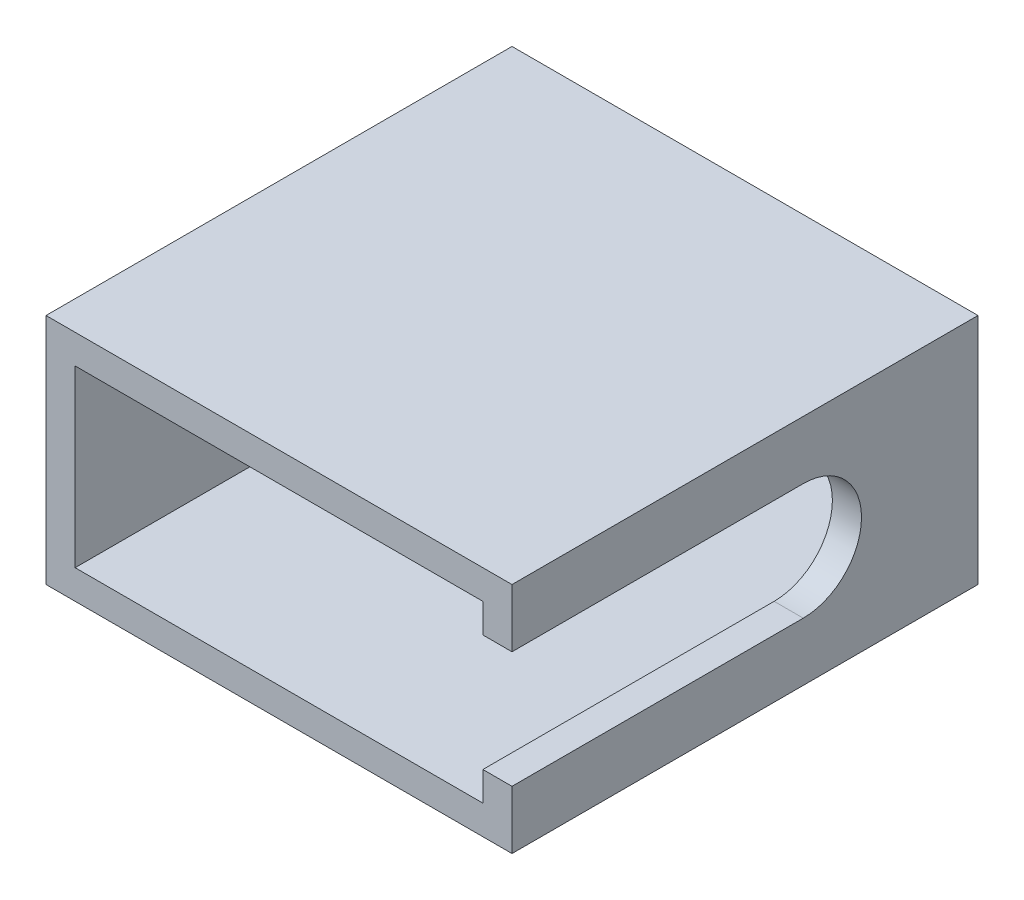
ISO-10303-21;
HEADER;
FILE_DESCRIPTION(('STEP AP214'),'2;1');
FILE_NAME('part.step','',(''),(''),'','','');
FILE_SCHEMA(('AUTOMOTIVE_DESIGN { 1 0 10303 214 1 1 1 1 }'));
ENDSEC;
DATA;
#1=APPLICATION_CONTEXT('core data for automotive mechanical design processes');
#2=APPLICATION_PROTOCOL_DEFINITION('international standard','automotive_design',2000,#1);
#3=PRODUCT_CONTEXT('',#1,'mechanical');
#4=PRODUCT('Part','Part','',(#3));
#5=PRODUCT_RELATED_PRODUCT_CATEGORY('part','',(#4));
#6=PRODUCT_DEFINITION_FORMATION('','',#4);
#7=PRODUCT_DEFINITION_CONTEXT('part definition',#1,'design');
#8=PRODUCT_DEFINITION('design','',#6,#7);
#9=PRODUCT_DEFINITION_SHAPE('','',#8);
#10=(LENGTH_UNIT() NAMED_UNIT(*) SI_UNIT(.MILLI.,.METRE.));
#11=(NAMED_UNIT(*) PLANE_ANGLE_UNIT() SI_UNIT($,.RADIAN.));
#12=(NAMED_UNIT(*) SI_UNIT($,.STERADIAN.) SOLID_ANGLE_UNIT());
#13=UNCERTAINTY_MEASURE_WITH_UNIT(LENGTH_MEASURE(1.E-05),#10,'distance_accuracy_value','');
#14=(GEOMETRIC_REPRESENTATION_CONTEXT(3) GLOBAL_UNCERTAINTY_ASSIGNED_CONTEXT((#13)) GLOBAL_UNIT_ASSIGNED_CONTEXT((#10,
#11,#12)) REPRESENTATION_CONTEXT('',''));
#15=CARTESIAN_POINT('',(0.,0.,0.));
#16=DIRECTION('',(0.,0.,1.));
#17=DIRECTION('',(1.,0.,0.));
#18=AXIS2_PLACEMENT_3D('',#15,#16,#17);
#19=CARTESIAN_POINT('',(-25.4,-12.7,0.));
#20=DIRECTION('',(0.,-1.,0.));
#21=DIRECTION('',(0.,0.,-1.));
#22=AXIS2_PLACEMENT_3D('',#19,#20,#21);
#23=PLANE('',#22);
#24=DIRECTION('',(1.,0.,0.));
#25=VECTOR('',#24,1.);
#26=CARTESIAN_POINT('',(-25.4,-12.7,50.8));
#27=LINE('',#26,#25);
#28=CARTESIAN_POINT('',(-25.4,-12.7,50.8));
#29=VERTEX_POINT('',#28);
#30=CARTESIAN_POINT('',(25.4,-12.7,50.8));
#31=VERTEX_POINT('',#30);
#32=EDGE_CURVE('E147',#29,#31,#27,.T.);
#33=ORIENTED_EDGE('',*,*,#32,.F.);
#34=DIRECTION('',(0.,0.,1.));
#35=VECTOR('',#34,1.);
#36=CARTESIAN_POINT('',(-25.4,-12.7,0.));
#37=LINE('',#36,#35);
#38=CARTESIAN_POINT('',(-25.4,-12.7,0.));
#39=VERTEX_POINT('',#38);
#40=EDGE_CURVE('E11',#39,#29,#37,.T.);
#41=ORIENTED_EDGE('',*,*,#40,.F.);
#42=DIRECTION('',(1.,0.,0.));
#43=VECTOR('',#42,1.);
#44=CARTESIAN_POINT('',(-25.4,-12.7,0.));
#45=LINE('',#44,#43);
#46=CARTESIAN_POINT('',(25.4,-12.7,0.));
#47=VERTEX_POINT('',#46);
#48=EDGE_CURVE('E157',#39,#47,#45,.T.);
#49=ORIENTED_EDGE('',*,*,#48,.T.);
#50=DIRECTION('',(0.,0.,1.));
#51=VECTOR('',#50,1.);
#52=CARTESIAN_POINT('',(25.4,-12.7,0.));
#53=LINE('',#52,#51);
#54=EDGE_CURVE('E34',#47,#31,#53,.T.);
#55=ORIENTED_EDGE('',*,*,#54,.T.);
#56=EDGE_LOOP('',(#33,#41,#49,#55));
#57=FACE_BOUND('',#56,.T.);
#58=ADVANCED_FACE('F31',(#57),#23,.T.);
#59=CARTESIAN_POINT('',(-25.4,12.7,0.));
#60=DIRECTION('',(-1.,0.,0.));
#61=DIRECTION('',(0.,0.,1.));
#62=AXIS2_PLACEMENT_3D('',#59,#60,#61);
#63=PLANE('',#62);
#64=DIRECTION('',(0.,-1.,0.));
#65=VECTOR('',#64,1.);
#66=CARTESIAN_POINT('',(-25.4,12.7,50.8));
#67=LINE('',#66,#65);
#68=CARTESIAN_POINT('',(-25.4,12.7,50.8));
#69=VERTEX_POINT('',#68);
#70=EDGE_CURVE('E152',#69,#29,#67,.T.);
#71=ORIENTED_EDGE('',*,*,#70,.F.);
#72=DIRECTION('',(0.,0.,1.));
#73=VECTOR('',#72,1.);
#74=CARTESIAN_POINT('',(-25.4,12.7,0.));
#75=LINE('',#74,#73);
#76=CARTESIAN_POINT('',(-25.4,12.7,0.));
#77=VERTEX_POINT('',#76);
#78=EDGE_CURVE('E39',#77,#69,#75,.T.);
#79=ORIENTED_EDGE('',*,*,#78,.F.);
#80=DIRECTION('',(0.,-1.,0.));
#81=VECTOR('',#80,1.);
#82=CARTESIAN_POINT('',(-25.4,12.7,0.));
#83=LINE('',#82,#81);
#84=EDGE_CURVE('E164',#77,#39,#83,.T.);
#85=ORIENTED_EDGE('',*,*,#84,.T.);
#86=ORIENTED_EDGE('',*,*,#40,.T.);
#87=EDGE_LOOP('',(#71,#79,#85,#86));
#88=FACE_BOUND('',#87,.T.);
#89=ADVANCED_FACE('F249',(#88),#63,.T.);
#90=CARTESIAN_POINT('',(25.4,12.7,0.));
#91=DIRECTION('',(0.,1.,0.));
#92=DIRECTION('',(0.,0.,1.));
#93=AXIS2_PLACEMENT_3D('',#90,#91,#92);
#94=PLANE('',#93);
#95=DIRECTION('',(-1.,0.,0.));
#96=VECTOR('',#95,1.);
#97=CARTESIAN_POINT('',(25.4,12.7,50.8));
#98=LINE('',#97,#96);
#99=CARTESIAN_POINT('',(25.4,12.7,50.8));
#100=VERTEX_POINT('',#99);
#101=EDGE_CURVE('E148',#100,#69,#98,.T.);
#102=ORIENTED_EDGE('',*,*,#101,.F.);
#103=DIRECTION('',(0.,0.,1.));
#104=VECTOR('',#103,1.);
#105=CARTESIAN_POINT('',(25.4,12.7,0.));
#106=LINE('',#105,#104);
#107=CARTESIAN_POINT('',(25.4,12.7,0.));
#108=VERTEX_POINT('',#107);
#109=EDGE_CURVE('E159',#108,#100,#106,.T.);
#110=ORIENTED_EDGE('',*,*,#109,.F.);
#111=DIRECTION('',(-1.,0.,0.));
#112=VECTOR('',#111,1.);
#113=CARTESIAN_POINT('',(25.4,12.7,0.));
#114=LINE('',#113,#112);
#115=EDGE_CURVE('E168',#108,#77,#114,.T.);
#116=ORIENTED_EDGE('',*,*,#115,.T.);
#117=ORIENTED_EDGE('',*,*,#78,.T.);
#118=EDGE_LOOP('',(#102,#110,#116,#117));
#119=FACE_BOUND('',#118,.T.);
#120=ADVANCED_FACE('F253',(#119),#94,.T.);
#121=CARTESIAN_POINT('',(25.4,-12.7,0.));
#122=DIRECTION('',(1.,0.,0.));
#123=DIRECTION('',(0.,0.,-1.));
#124=AXIS2_PLACEMENT_3D('',#121,#122,#123);
#125=PLANE('',#124);
#126=DIRECTION('',(0.,0.,1.));
#127=VECTOR('',#126,1.);
#128=CARTESIAN_POINT('',(25.4,-6.35,19.05));
#129=LINE('',#128,#127);
#130=CARTESIAN_POINT('',(25.4,-6.34999999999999,19.05));
#131=VERTEX_POINT('',#130);
#132=CARTESIAN_POINT('',(25.4,-6.35,50.8));
#133=VERTEX_POINT('',#132);
#134=EDGE_CURVE('E124',#131,#133,#129,.T.);
#135=ORIENTED_EDGE('',*,*,#134,.T.);
#136=DIRECTION('',(0.,1.,0.));
#137=VECTOR('',#136,1.);
#138=CARTESIAN_POINT('',(25.4,-12.7,50.8));
#139=LINE('',#138,#137);
#140=EDGE_CURVE('E137',#31,#133,#139,.T.);
#141=ORIENTED_EDGE('',*,*,#140,.F.);
#142=ORIENTED_EDGE('',*,*,#54,.F.);
#143=DIRECTION('',(0.,1.,0.));
#144=VECTOR('',#143,1.);
#145=CARTESIAN_POINT('',(25.4,-12.7,0.));
#146=LINE('',#145,#144);
#147=EDGE_CURVE('E172',#47,#108,#146,.T.);
#148=ORIENTED_EDGE('',*,*,#147,.T.);
#149=ORIENTED_EDGE('',*,*,#109,.T.);
#150=CARTESIAN_POINT('',(25.4,6.35,50.8));
#151=VERTEX_POINT('',#150);
#152=EDGE_CURVE('E149',#151,#100,#139,.T.);
#153=ORIENTED_EDGE('',*,*,#152,.F.);
#154=DIRECTION('',(0.,0.,-1.));
#155=VECTOR('',#154,1.);
#156=CARTESIAN_POINT('',(25.4,6.35,50.8));
#157=LINE('',#156,#155);
#158=CARTESIAN_POINT('',(25.4,6.35,19.05));
#159=VERTEX_POINT('',#158);
#160=EDGE_CURVE('E141',#151,#159,#157,.T.);
#161=ORIENTED_EDGE('',*,*,#160,.T.);
#162=CARTESIAN_POINT('',(25.4,0.,19.05));
#163=DIRECTION('',(-1.,0.,0.));
#164=DIRECTION('',(0.,0.,1.));
#165=AXIS2_PLACEMENT_3D('',#162,#163,#164);
#166=CIRCLE('',#165,6.35);
#167=EDGE_CURVE('E132',#159,#131,#166,.T.);
#168=ORIENTED_EDGE('',*,*,#167,.T.);
#169=EDGE_LOOP('',(#135,#141,#142,#148,#149,#153,#161,#168));
#170=FACE_BOUND('',#169,.T.);
#171=ADVANCED_FACE('F136',(#170),#125,.T.);
#172=CARTESIAN_POINT('',(25.4,-12.7,0.));
#173=DIRECTION('',(0.,0.,1.));
#174=DIRECTION('',(1.,0.,0.));
#175=AXIS2_PLACEMENT_3D('',#172,#173,#174);
#176=PLANE('',#175);
#177=DIRECTION('',(-1.,0.,0.));
#178=VECTOR('',#177,1.);
#179=CARTESIAN_POINT('',(-22.225,9.525,0.));
#180=LINE('',#179,#178);
#181=CARTESIAN_POINT('',(22.225,9.525,0.));
#182=VERTEX_POINT('',#181);
#183=CARTESIAN_POINT('',(-22.225,9.525,0.));
#184=VERTEX_POINT('',#183);
#185=EDGE_CURVE('E181',#182,#184,#180,.T.);
#186=ORIENTED_EDGE('',*,*,#185,.T.);
#187=DIRECTION('',(0.,-1.,0.));
#188=VECTOR('',#187,1.);
#189=CARTESIAN_POINT('',(-22.225,-9.525,0.));
#190=LINE('',#189,#188);
#191=CARTESIAN_POINT('',(-22.225,-9.525,0.));
#192=VERTEX_POINT('',#191);
#193=EDGE_CURVE('E191',#184,#192,#190,.T.);
#194=ORIENTED_EDGE('',*,*,#193,.T.);
#195=DIRECTION('',(1.,0.,0.));
#196=VECTOR('',#195,1.);
#197=CARTESIAN_POINT('',(22.225,-9.525,0.));
#198=LINE('',#197,#196);
#199=CARTESIAN_POINT('',(22.225,-9.525,0.));
#200=VERTEX_POINT('',#199);
#201=EDGE_CURVE('E204',#192,#200,#198,.T.);
#202=ORIENTED_EDGE('',*,*,#201,.T.);
#203=DIRECTION('',(0.,1.,0.));
#204=VECTOR('',#203,1.);
#205=CARTESIAN_POINT('',(22.225,9.525,0.));
#206=LINE('',#205,#204);
#207=EDGE_CURVE('E55',#200,#182,#206,.T.);
#208=ORIENTED_EDGE('',*,*,#207,.T.);
#209=EDGE_LOOP('',(#186,#194,#202,#208));
#210=FACE_BOUND('',#209,.T.);
#211=ORIENTED_EDGE('',*,*,#48,.F.);
#212=ORIENTED_EDGE('',*,*,#84,.F.);
#213=ORIENTED_EDGE('',*,*,#115,.F.);
#214=ORIENTED_EDGE('',*,*,#147,.F.);
#215=EDGE_LOOP('',(#211,#212,#213,#214));
#216=FACE_BOUND('',#215,.T.);
#217=ADVANCED_FACE('F230',(#210,#216),#176,.F.);
#218=CARTESIAN_POINT('',(25.4,-12.7,50.8));
#219=DIRECTION('',(0.,0.,1.));
#220=DIRECTION('',(1.,0.,0.));
#221=AXIS2_PLACEMENT_3D('',#218,#219,#220);
#222=PLANE('',#221);
#223=DIRECTION('',(-1.,0.,0.));
#224=VECTOR('',#223,1.);
#225=CARTESIAN_POINT('',(25.4,-6.35,50.8));
#226=LINE('',#225,#224);
#227=CARTESIAN_POINT('',(22.225,-6.35,50.8));
#228=VERTEX_POINT('',#227);
#229=EDGE_CURVE('E121',#133,#228,#226,.T.);
#230=ORIENTED_EDGE('',*,*,#229,.T.);
#231=DIRECTION('',(0.,1.,0.));
#232=VECTOR('',#231,1.);
#233=CARTESIAN_POINT('',(22.225,9.525,50.8));
#234=LINE('',#233,#232);
#235=CARTESIAN_POINT('',(22.225,-9.525,50.8));
#236=VERTEX_POINT('',#235);
#237=EDGE_CURVE('E192',#236,#228,#234,.T.);
#238=ORIENTED_EDGE('',*,*,#237,.F.);
#239=DIRECTION('',(1.,0.,0.));
#240=VECTOR('',#239,1.);
#241=CARTESIAN_POINT('',(22.225,-9.525,50.8));
#242=LINE('',#241,#240);
#243=CARTESIAN_POINT('',(-22.225,-9.525,50.8));
#244=VERTEX_POINT('',#243);
#245=EDGE_CURVE('E195',#244,#236,#242,.T.);
#246=ORIENTED_EDGE('',*,*,#245,.F.);
#247=DIRECTION('',(0.,-1.,0.));
#248=VECTOR('',#247,1.);
#249=CARTESIAN_POINT('',(-22.225,-9.525,50.8));
#250=LINE('',#249,#248);
#251=CARTESIAN_POINT('',(-22.225,9.525,50.8));
#252=VERTEX_POINT('',#251);
#253=EDGE_CURVE('E198',#252,#244,#250,.T.);
#254=ORIENTED_EDGE('',*,*,#253,.F.);
#255=DIRECTION('',(-1.,0.,0.));
#256=VECTOR('',#255,1.);
#257=CARTESIAN_POINT('',(-22.225,9.525,50.8));
#258=LINE('',#257,#256);
#259=CARTESIAN_POINT('',(22.225,9.525,50.8));
#260=VERTEX_POINT('',#259);
#261=EDGE_CURVE('E188',#260,#252,#258,.T.);
#262=ORIENTED_EDGE('',*,*,#261,.F.);
#263=CARTESIAN_POINT('',(22.225,6.35,50.8));
#264=VERTEX_POINT('',#263);
#265=EDGE_CURVE('E194',#264,#260,#234,.T.);
#266=ORIENTED_EDGE('',*,*,#265,.F.);
#267=DIRECTION('',(-1.,0.,0.));
#268=VECTOR('',#267,1.);
#269=CARTESIAN_POINT('',(25.4,6.35,50.8));
#270=LINE('',#269,#268);
#271=EDGE_CURVE('E47',#151,#264,#270,.T.);
#272=ORIENTED_EDGE('',*,*,#271,.F.);
#273=ORIENTED_EDGE('',*,*,#152,.T.);
#274=ORIENTED_EDGE('',*,*,#101,.T.);
#275=ORIENTED_EDGE('',*,*,#70,.T.);
#276=ORIENTED_EDGE('',*,*,#32,.T.);
#277=ORIENTED_EDGE('',*,*,#140,.T.);
#278=EDGE_LOOP('',(#230,#238,#246,#254,#262,#266,#272,#273,#274,#275,#276,#277));
#279=FACE_BOUND('',#278,.T.);
#280=ADVANCED_FACE('F144',(#279),#222,.T.);
#281=CARTESIAN_POINT('',(-22.225,-9.525,0.));
#282=DIRECTION('',(-1.,0.,0.));
#283=DIRECTION('',(0.,0.,1.));
#284=AXIS2_PLACEMENT_3D('',#281,#282,#283);
#285=PLANE('',#284);
#286=ORIENTED_EDGE('',*,*,#253,.T.);
#287=DIRECTION('',(0.,0.,1.));
#288=VECTOR('',#287,1.);
#289=CARTESIAN_POINT('',(-22.225,-9.525,0.));
#290=LINE('',#289,#288);
#291=EDGE_CURVE('E177',#192,#244,#290,.T.);
#292=ORIENTED_EDGE('',*,*,#291,.F.);
#293=ORIENTED_EDGE('',*,*,#193,.F.);
#294=DIRECTION('',(0.,0.,1.));
#295=VECTOR('',#294,1.);
#296=CARTESIAN_POINT('',(-22.225,9.525,0.));
#297=LINE('',#296,#295);
#298=EDGE_CURVE('E186',#184,#252,#297,.T.);
#299=ORIENTED_EDGE('',*,*,#298,.T.);
#300=EDGE_LOOP('',(#286,#292,#293,#299));
#301=FACE_BOUND('',#300,.T.);
#302=ADVANCED_FACE('F237',(#301),#285,.F.);
#303=CARTESIAN_POINT('',(-22.225,9.525,0.));
#304=DIRECTION('',(0.,1.,0.));
#305=DIRECTION('',(0.,0.,1.));
#306=AXIS2_PLACEMENT_3D('',#303,#304,#305);
#307=PLANE('',#306);
#308=ORIENTED_EDGE('',*,*,#261,.T.);
#309=ORIENTED_EDGE('',*,*,#298,.F.);
#310=ORIENTED_EDGE('',*,*,#185,.F.);
#311=DIRECTION('',(0.,0.,1.));
#312=VECTOR('',#311,1.);
#313=CARTESIAN_POINT('',(22.225,9.525,0.));
#314=LINE('',#313,#312);
#315=EDGE_CURVE('E183',#182,#260,#314,.T.);
#316=ORIENTED_EDGE('',*,*,#315,.T.);
#317=EDGE_LOOP('',(#308,#309,#310,#316));
#318=FACE_BOUND('',#317,.T.);
#319=ADVANCED_FACE('F227',(#318),#307,.F.);
#320=CARTESIAN_POINT('',(22.225,9.525,0.));
#321=DIRECTION('',(1.,0.,0.));
#322=DIRECTION('',(0.,0.,-1.));
#323=AXIS2_PLACEMENT_3D('',#320,#321,#322);
#324=PLANE('',#323);
#325=ORIENTED_EDGE('',*,*,#237,.T.);
#326=DIRECTION('',(0.,0.,1.));
#327=VECTOR('',#326,1.);
#328=CARTESIAN_POINT('',(22.225,-6.35,19.05));
#329=LINE('',#328,#327);
#330=CARTESIAN_POINT('',(22.225,-6.34999999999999,19.05));
#331=VERTEX_POINT('',#330);
#332=EDGE_CURVE('E127',#331,#228,#329,.T.);
#333=ORIENTED_EDGE('',*,*,#332,.F.);
#334=CARTESIAN_POINT('',(22.225,0.,19.05));
#335=DIRECTION('',(-1.,0.,0.));
#336=DIRECTION('',(0.,0.,1.));
#337=AXIS2_PLACEMENT_3D('',#334,#335,#336);
#338=CIRCLE('',#337,6.35);
#339=CARTESIAN_POINT('',(22.225,6.35,19.05));
#340=VERTEX_POINT('',#339);
#341=EDGE_CURVE('E142',#340,#331,#338,.T.);
#342=ORIENTED_EDGE('',*,*,#341,.F.);
#343=DIRECTION('',(0.,0.,-1.));
#344=VECTOR('',#343,1.);
#345=CARTESIAN_POINT('',(22.225,6.35,50.8));
#346=LINE('',#345,#344);
#347=EDGE_CURVE('E215',#264,#340,#346,.T.);
#348=ORIENTED_EDGE('',*,*,#347,.F.);
#349=ORIENTED_EDGE('',*,*,#265,.T.);
#350=ORIENTED_EDGE('',*,*,#315,.F.);
#351=ORIENTED_EDGE('',*,*,#207,.F.);
#352=DIRECTION('',(0.,0.,1.));
#353=VECTOR('',#352,1.);
#354=CARTESIAN_POINT('',(22.225,-9.525,0.));
#355=LINE('',#354,#353);
#356=EDGE_CURVE('E180',#200,#236,#355,.T.);
#357=ORIENTED_EDGE('',*,*,#356,.T.);
#358=EDGE_LOOP('',(#325,#333,#342,#348,#349,#350,#351,#357));
#359=FACE_BOUND('',#358,.T.);
#360=ADVANCED_FACE('F223',(#359),#324,.F.);
#361=CARTESIAN_POINT('',(22.225,-9.525,0.));
#362=DIRECTION('',(0.,-1.,0.));
#363=DIRECTION('',(0.,0.,-1.));
#364=AXIS2_PLACEMENT_3D('',#361,#362,#363);
#365=PLANE('',#364);
#366=ORIENTED_EDGE('',*,*,#245,.T.);
#367=ORIENTED_EDGE('',*,*,#356,.F.);
#368=ORIENTED_EDGE('',*,*,#201,.F.);
#369=ORIENTED_EDGE('',*,*,#291,.T.);
#370=EDGE_LOOP('',(#366,#367,#368,#369));
#371=FACE_BOUND('',#370,.T.);
#372=ADVANCED_FACE('F234',(#371),#365,.F.);
#373=CARTESIAN_POINT('',(25.4,-6.35,19.05));
#374=DIRECTION('',(0.,-1.,0.));
#375=DIRECTION('',(0.,0.,-1.));
#376=AXIS2_PLACEMENT_3D('',#373,#374,#375);
#377=PLANE('',#376);
#378=ORIENTED_EDGE('',*,*,#332,.T.);
#379=ORIENTED_EDGE('',*,*,#229,.F.);
#380=ORIENTED_EDGE('',*,*,#134,.F.);
#381=DIRECTION('',(-1.,0.,0.));
#382=VECTOR('',#381,1.);
#383=CARTESIAN_POINT('',(25.4,-6.34999999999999,19.05));
#384=LINE('',#383,#382);
#385=EDGE_CURVE('E200',#131,#331,#384,.T.);
#386=ORIENTED_EDGE('',*,*,#385,.T.);
#387=EDGE_LOOP('',(#378,#379,#380,#386));
#388=FACE_BOUND('',#387,.T.);
#389=ADVANCED_FACE('F123',(#388),#377,.F.);
#390=CARTESIAN_POINT('',(25.4,0.,19.05));
#391=DIRECTION('',(-1.,0.,0.));
#392=DIRECTION('',(0.,0.,1.));
#393=AXIS2_PLACEMENT_3D('',#390,#391,#392);
#394=CYLINDRICAL_SURFACE('',#393,6.35);
#395=ORIENTED_EDGE('',*,*,#341,.T.);
#396=ORIENTED_EDGE('',*,*,#385,.F.);
#397=ORIENTED_EDGE('',*,*,#167,.F.);
#398=DIRECTION('',(-1.,0.,0.));
#399=VECTOR('',#398,1.);
#400=CARTESIAN_POINT('',(25.4,6.35,19.05));
#401=LINE('',#400,#399);
#402=EDGE_CURVE('E210',#159,#340,#401,.T.);
#403=ORIENTED_EDGE('',*,*,#402,.T.);
#404=EDGE_LOOP('',(#395,#396,#397,#403));
#405=FACE_BOUND('',#404,.T.);
#406=ADVANCED_FACE('F305',(#405),#394,.F.);
#407=CARTESIAN_POINT('',(25.4,6.35,50.8));
#408=DIRECTION('',(0.,1.,0.));
#409=DIRECTION('',(0.,0.,1.));
#410=AXIS2_PLACEMENT_3D('',#407,#408,#409);
#411=PLANE('',#410);
#412=ORIENTED_EDGE('',*,*,#347,.T.);
#413=ORIENTED_EDGE('',*,*,#402,.F.);
#414=ORIENTED_EDGE('',*,*,#160,.F.);
#415=ORIENTED_EDGE('',*,*,#271,.T.);
#416=EDGE_LOOP('',(#412,#413,#414,#415));
#417=FACE_BOUND('',#416,.T.);
#418=ADVANCED_FACE('F219',(#417),#411,.F.);
#419=CLOSED_SHELL('',(#58,#89,#120,#171,#217,#280,#302,#319,#360,#372,#389,#406,#418));
#420=MANIFOLD_SOLID_BREP('B2',#419);
#421=ADVANCED_BREP_SHAPE_REPRESENTATION('',(#18,#420),#14);
#422=SHAPE_DEFINITION_REPRESENTATION(#9,#421);
ENDSEC;
END-ISO-10303-21;
